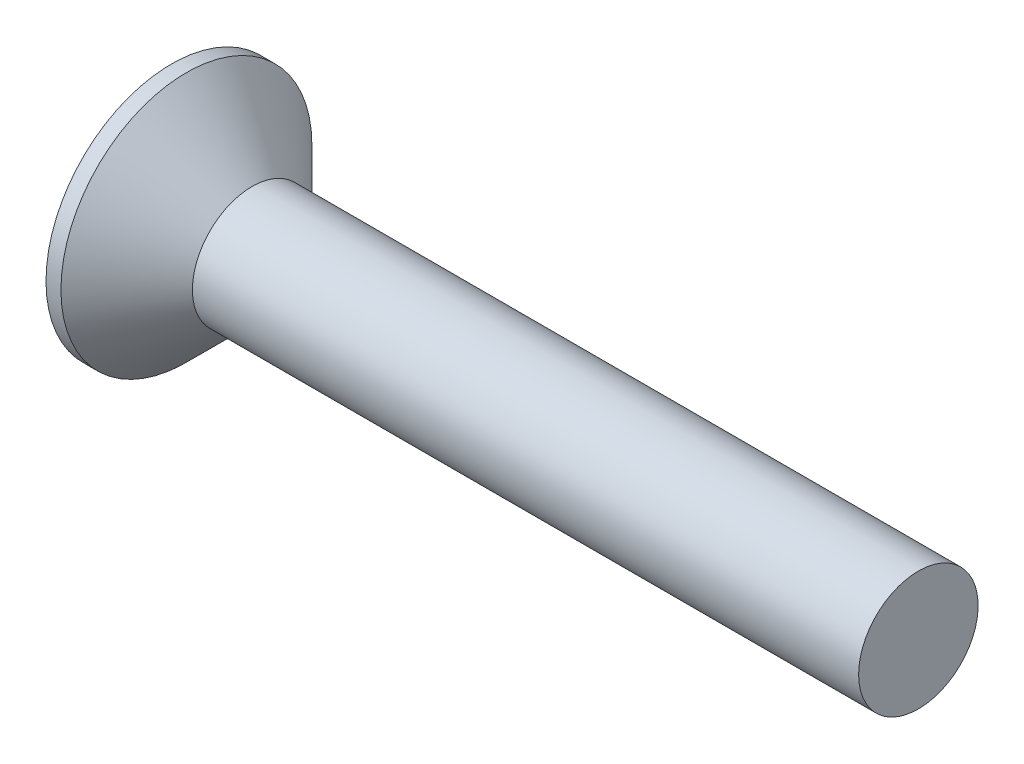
from build123d import *

# Parameters (mm, degrees)
CIRPATTERN1_COUNT = 2
CIRPATTERN1_ANGLE = 90


with BuildPart() as part:
    # BodySke → Base-Revolve (revolve)
    with BuildSketch(Plane.XY, mode=Mode.PRIVATE) as base_revolve_sk:
        Polygon((0, 0), (0, 4.2), (0.5, 4.2), (2.7, 2), (25, 2), (25, 0), align=None)
    revolve(base_revolve_sk.sketch.rotate(Axis((-6.35, 0, 0), (1, 0, 0)), 90), axis=Axis((-6.35, 0, 0), (1, 0, 0)))

    # Sketch3 → Cross section 0
    with BuildSketch(Plane.ZY):
        with BuildLine():
            Line((-0.48, 2.23), (0.48, 2.23))
            Line((0.48, 2.23), (0.48, -2.23))
            Line((0.48, -2.23), (-0.48, -2.23))
            Line((-0.48, -2.23), (-0.48, 2.23))
        make_face()
    # Sketch4 → Cross section 1
    with BuildSketch(Plane.ZY.offset(-2.65)):
        with BuildLine():
            Line((-0.24, 0.24), (0.24, 0.24))
            Line((0.24, 0.24), (0.24, -0.24))
            Line((0.24, -0.24), (-0.24, -0.24))
            Line((-0.24, -0.24), (-0.24, 0.24))
        make_face()
    cross = loft(mode=Mode.SUBTRACT)

    # CirPattern1: Cross ×2 about axis
    cirpattern1_axis = Axis((0, 0, 0), (1, 0, 0))
    for i in range(1, CIRPATTERN1_COUNT):
        add(cross.rotate(cirpattern1_axis, i * CIRPATTERN1_ANGLE / (CIRPATTERN1_COUNT - 1)), mode=Mode.SUBTRACT)


solid = part.part
